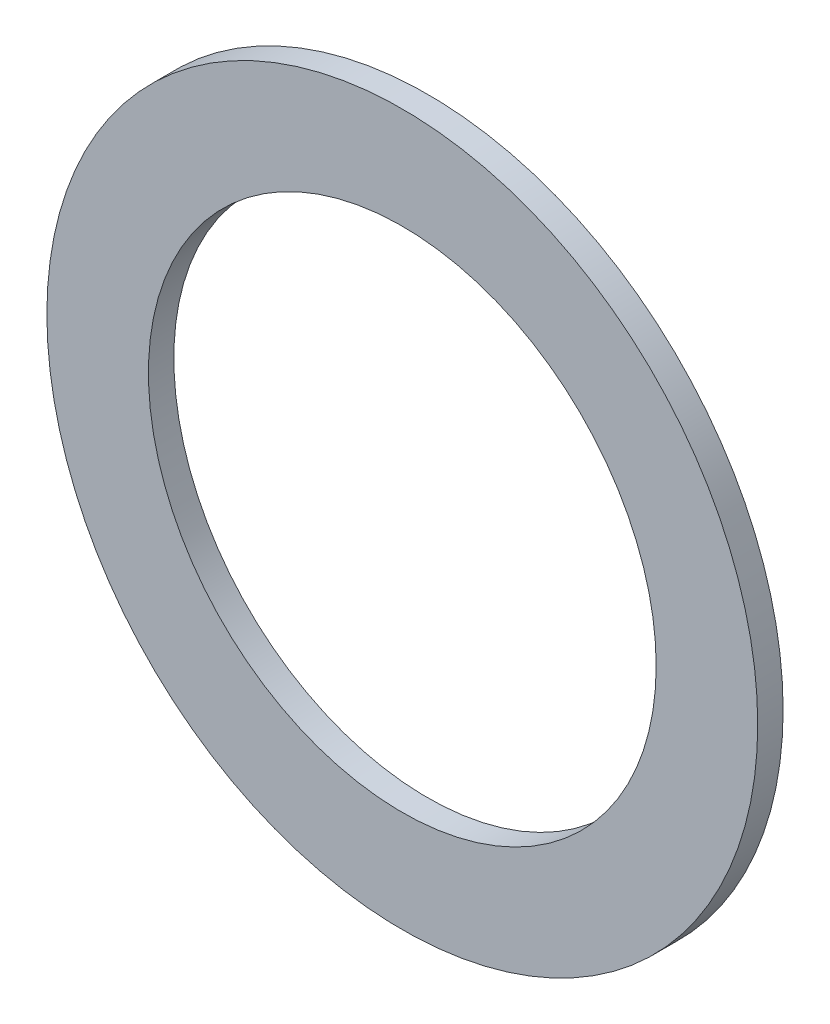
ISO-10303-21;
HEADER;
FILE_DESCRIPTION(('STEP AP214'),'2;1');
FILE_NAME('part.step','',(''),(''),'','','');
FILE_SCHEMA(('AUTOMOTIVE_DESIGN { 1 0 10303 214 1 1 1 1 }'));
ENDSEC;
DATA;
#1=APPLICATION_CONTEXT('core data for automotive mechanical design processes');
#2=APPLICATION_PROTOCOL_DEFINITION('international standard','automotive_design',2000,#1);
#3=PRODUCT_CONTEXT('',#1,'mechanical');
#4=PRODUCT('Part','Part','',(#3));
#5=PRODUCT_RELATED_PRODUCT_CATEGORY('part','',(#4));
#6=PRODUCT_DEFINITION_FORMATION('','',#4);
#7=PRODUCT_DEFINITION_CONTEXT('part definition',#1,'design');
#8=PRODUCT_DEFINITION('design','',#6,#7);
#9=PRODUCT_DEFINITION_SHAPE('','',#8);
#10=(LENGTH_UNIT() NAMED_UNIT(*) SI_UNIT(.MILLI.,.METRE.));
#11=(NAMED_UNIT(*) PLANE_ANGLE_UNIT() SI_UNIT($,.RADIAN.));
#12=(NAMED_UNIT(*) SI_UNIT($,.STERADIAN.) SOLID_ANGLE_UNIT());
#13=UNCERTAINTY_MEASURE_WITH_UNIT(LENGTH_MEASURE(1.E-05),#10,'distance_accuracy_value','');
#14=(GEOMETRIC_REPRESENTATION_CONTEXT(3) GLOBAL_UNCERTAINTY_ASSIGNED_CONTEXT((#13)) GLOBAL_UNIT_ASSIGNED_CONTEXT((#10,
#11,#12)) REPRESENTATION_CONTEXT('',''));
#15=CARTESIAN_POINT('',(0.,0.,0.));
#16=DIRECTION('',(0.,0.,1.));
#17=DIRECTION('',(1.,0.,0.));
#18=AXIS2_PLACEMENT_3D('',#15,#16,#17);
#19=CARTESIAN_POINT('',(0.,0.,0.));
#20=DIRECTION('',(0.,0.,1.));
#21=DIRECTION('',(1.,0.,0.));
#22=AXIS2_PLACEMENT_3D('',#19,#20,#21);
#23=PLANE('',#22);
#24=CARTESIAN_POINT('',(0.,0.,0.));
#25=DIRECTION('',(0.,0.,1.));
#26=DIRECTION('',(1.,0.,0.));
#27=AXIS2_PLACEMENT_3D('',#24,#25,#26);
#28=CIRCLE('',#27,5.);
#29=CARTESIAN_POINT('',(5.,0.,0.));
#30=VERTEX_POINT('',#29);
#31=EDGE_CURVE('E31',#30,#30,#28,.T.);
#32=ORIENTED_EDGE('',*,*,#31,.T.);
#33=EDGE_LOOP('',(#32));
#34=FACE_BOUND('',#33,.T.);
#35=CARTESIAN_POINT('',(0.,0.,0.));
#36=DIRECTION('',(0.,0.,1.));
#37=DIRECTION('',(1.,0.,0.));
#38=AXIS2_PLACEMENT_3D('',#35,#36,#37);
#39=CIRCLE('',#38,7.);
#40=CARTESIAN_POINT('',(7.,0.,0.));
#41=VERTEX_POINT('',#40);
#42=EDGE_CURVE('E10',#41,#41,#39,.T.);
#43=ORIENTED_EDGE('',*,*,#42,.F.);
#44=EDGE_LOOP('',(#43));
#45=FACE_BOUND('',#44,.T.);
#46=ADVANCED_FACE('F15',(#34,#45),#23,.F.);
#47=CARTESIAN_POINT('',(0.,0.,0.5));
#48=DIRECTION('',(0.,0.,1.));
#49=DIRECTION('',(1.,0.,0.));
#50=AXIS2_PLACEMENT_3D('',#47,#48,#49);
#51=PLANE('',#50);
#52=CARTESIAN_POINT('',(0.,0.,0.5));
#53=DIRECTION('',(0.,0.,1.));
#54=DIRECTION('',(1.,0.,0.));
#55=AXIS2_PLACEMENT_3D('',#52,#53,#54);
#56=CIRCLE('',#55,5.);
#57=CARTESIAN_POINT('',(5.,0.,0.5));
#58=VERTEX_POINT('',#57);
#59=EDGE_CURVE('E38',#58,#58,#56,.T.);
#60=ORIENTED_EDGE('',*,*,#59,.F.);
#61=EDGE_LOOP('',(#60));
#62=FACE_BOUND('',#61,.T.);
#63=CARTESIAN_POINT('',(0.,0.,0.5));
#64=DIRECTION('',(0.,0.,1.));
#65=DIRECTION('',(1.,0.,0.));
#66=AXIS2_PLACEMENT_3D('',#63,#64,#65);
#67=CIRCLE('',#66,7.);
#68=CARTESIAN_POINT('',(7.,0.,0.5));
#69=VERTEX_POINT('',#68);
#70=EDGE_CURVE('E22',#69,#69,#67,.T.);
#71=ORIENTED_EDGE('',*,*,#70,.T.);
#72=EDGE_LOOP('',(#71));
#73=FACE_BOUND('',#72,.T.);
#74=ADVANCED_FACE('F49',(#62,#73),#51,.T.);
#75=CARTESIAN_POINT('',(0.,0.,0.5));
#76=DIRECTION('',(0.,0.,-1.));
#77=DIRECTION('',(-1.,0.,0.));
#78=AXIS2_PLACEMENT_3D('',#75,#76,#77);
#79=CYLINDRICAL_SURFACE('',#78,7.);
#80=ORIENTED_EDGE('',*,*,#42,.T.);
#81=EDGE_LOOP('',(#80));
#82=FACE_BOUND('',#81,.T.);
#83=ORIENTED_EDGE('',*,*,#70,.F.);
#84=EDGE_LOOP('',(#83));
#85=FACE_BOUND('',#84,.T.);
#86=ADVANCED_FACE('F51',(#82,#85),#79,.T.);
#87=CARTESIAN_POINT('',(0.,0.,0.5));
#88=DIRECTION('',(0.,0.,-1.));
#89=DIRECTION('',(-1.,0.,0.));
#90=AXIS2_PLACEMENT_3D('',#87,#88,#89);
#91=CYLINDRICAL_SURFACE('',#90,5.);
#92=ORIENTED_EDGE('',*,*,#31,.F.);
#93=EDGE_LOOP('',(#92));
#94=FACE_BOUND('',#93,.T.);
#95=ORIENTED_EDGE('',*,*,#59,.T.);
#96=EDGE_LOOP('',(#95));
#97=FACE_BOUND('',#96,.T.);
#98=ADVANCED_FACE('F47',(#94,#97),#91,.F.);
#99=CLOSED_SHELL('',(#46,#74,#86,#98));
#100=MANIFOLD_SOLID_BREP('B1',#99);
#101=ADVANCED_BREP_SHAPE_REPRESENTATION('',(#18,#100),#14);
#102=SHAPE_DEFINITION_REPRESENTATION(#9,#101);
ENDSEC;
END-ISO-10303-21;
